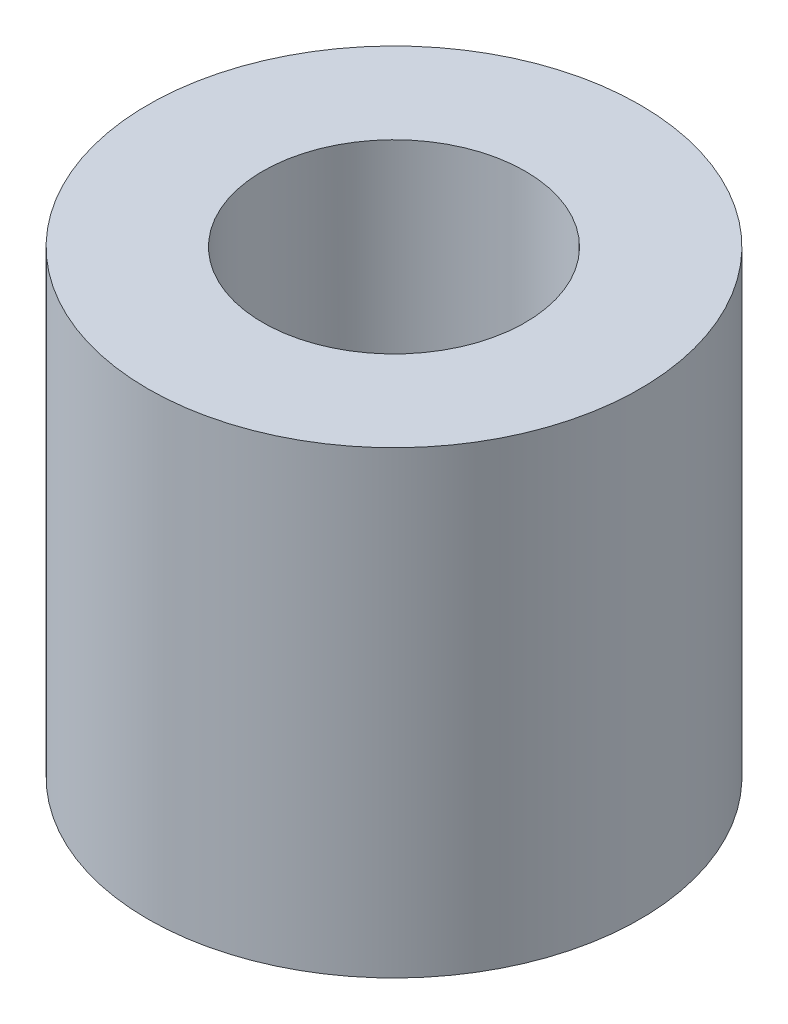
from build123d import *

# Parameters (mm, degrees)
SKETCH1_R      = 7.5
EXTRUDE1_DEPTH = 14


with BuildPart() as part:
    # Sketch1 → Extrude1 (new body)
    with BuildSketch(Plane(origin=(0, 0, 0), x_dir=(1, 0, 0), z_dir=(0, 1, 0))):
        with Locations(Location((0, 0, 0), (0, 0, 270))):
            Circle(SKETCH1_R)
    extrude(amount=EXTRUDE1_DEPTH)

    # Sketch2 → Cut-Revolve1 (revolve, cut)
    with BuildSketch(Plane.XY, mode=Mode.PRIVATE) as cut_revolve1_sk:
        Polygon((0, 14), (4, 14), (4, 4), (0, 1.690598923), align=None)
    revolve(cut_revolve1_sk.sketch.rotate(Axis((0, 0, 0), (0, 1, 0)), 90), axis=Axis((0, 0, 0), (0, 1, 0)), mode=Mode.SUBTRACT)


solid = part.part
